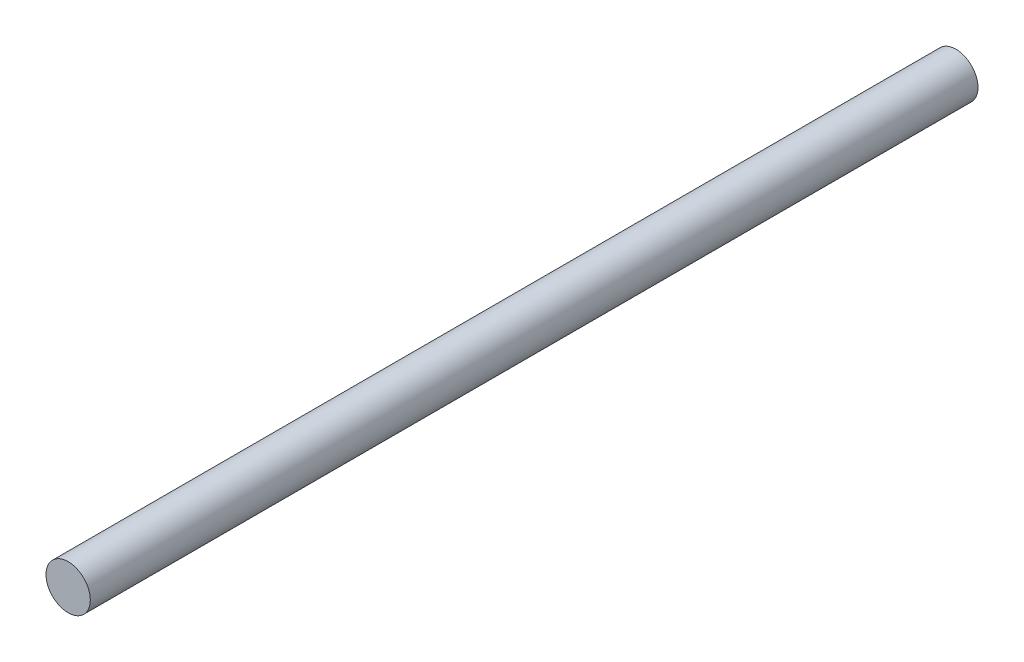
ISO-10303-21;
HEADER;
FILE_DESCRIPTION(('STEP AP214'),'2;1');
FILE_NAME('part.step','',(''),(''),'','','');
FILE_SCHEMA(('AUTOMOTIVE_DESIGN { 1 0 10303 214 1 1 1 1 }'));
ENDSEC;
DATA;
#1=APPLICATION_CONTEXT('core data for automotive mechanical design processes');
#2=APPLICATION_PROTOCOL_DEFINITION('international standard','automotive_design',2000,#1);
#3=PRODUCT_CONTEXT('',#1,'mechanical');
#4=PRODUCT('Part','Part','',(#3));
#5=PRODUCT_RELATED_PRODUCT_CATEGORY('part','',(#4));
#6=PRODUCT_DEFINITION_FORMATION('','',#4);
#7=PRODUCT_DEFINITION_CONTEXT('part definition',#1,'design');
#8=PRODUCT_DEFINITION('design','',#6,#7);
#9=PRODUCT_DEFINITION_SHAPE('','',#8);
#10=(LENGTH_UNIT() NAMED_UNIT(*) SI_UNIT(.MILLI.,.METRE.));
#11=(NAMED_UNIT(*) PLANE_ANGLE_UNIT() SI_UNIT($,.RADIAN.));
#12=(NAMED_UNIT(*) SI_UNIT($,.STERADIAN.) SOLID_ANGLE_UNIT());
#13=UNCERTAINTY_MEASURE_WITH_UNIT(LENGTH_MEASURE(1.E-05),#10,'distance_accuracy_value','');
#14=(GEOMETRIC_REPRESENTATION_CONTEXT(3) GLOBAL_UNCERTAINTY_ASSIGNED_CONTEXT((#13)) GLOBAL_UNIT_ASSIGNED_CONTEXT((#10,
#11,#12)) REPRESENTATION_CONTEXT('',''));
#15=CARTESIAN_POINT('',(0.,0.,0.));
#16=DIRECTION('',(0.,0.,1.));
#17=DIRECTION('',(1.,0.,0.));
#18=AXIS2_PLACEMENT_3D('',#15,#16,#17);
#19=CARTESIAN_POINT('',(0.,0.,32.0557346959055));
#20=DIRECTION('',(0.,0.,1.));
#21=DIRECTION('',(1.,0.,0.));
#22=AXIS2_PLACEMENT_3D('',#19,#20,#21);
#23=PLANE('',#22);
#24=CARTESIAN_POINT('',(0.,0.,32.0557346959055));
#25=DIRECTION('',(0.,0.,-1.));
#26=DIRECTION('',(-1.,0.,0.));
#27=AXIS2_PLACEMENT_3D('',#24,#25,#26);
#28=CIRCLE('',#27,1.6);
#29=CARTESIAN_POINT('',(-1.6,0.,32.0557346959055));
#30=VERTEX_POINT('',#29);
#31=EDGE_CURVE('E10',#30,#30,#28,.T.);
#32=ORIENTED_EDGE('',*,*,#31,.F.);
#33=EDGE_LOOP('',(#32));
#34=FACE_BOUND('',#33,.T.);
#35=ADVANCED_FACE('F15',(#34),#23,.T.);
#36=CARTESIAN_POINT('',(0.,0.,-32.0557346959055));
#37=DIRECTION('',(0.,0.,-1.));
#38=DIRECTION('',(-1.,0.,0.));
#39=AXIS2_PLACEMENT_3D('',#36,#37,#38);
#40=PLANE('',#39);
#41=CARTESIAN_POINT('',(0.,0.,-32.0557346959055));
#42=DIRECTION('',(0.,0.,1.));
#43=DIRECTION('',(1.,0.,0.));
#44=AXIS2_PLACEMENT_3D('',#41,#42,#43);
#45=CIRCLE('',#44,1.6);
#46=CARTESIAN_POINT('',(1.6,0.,-32.0557346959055));
#47=VERTEX_POINT('',#46);
#48=EDGE_CURVE('E22',#47,#47,#45,.T.);
#49=ORIENTED_EDGE('',*,*,#48,.F.);
#50=EDGE_LOOP('',(#49));
#51=FACE_BOUND('',#50,.T.);
#52=ADVANCED_FACE('F26',(#51),#40,.T.);
#53=CARTESIAN_POINT('',(0.,0.,-32.0557346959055));
#54=DIRECTION('',(0.,0.,1.));
#55=DIRECTION('',(1.,0.,0.));
#56=AXIS2_PLACEMENT_3D('',#53,#54,#55);
#57=CYLINDRICAL_SURFACE('',#56,1.6);
#58=ORIENTED_EDGE('',*,*,#31,.T.);
#59=EDGE_LOOP('',(#58));
#60=FACE_BOUND('',#59,.T.);
#61=ORIENTED_EDGE('',*,*,#48,.T.);
#62=EDGE_LOOP('',(#61));
#63=FACE_BOUND('',#62,.T.);
#64=ADVANCED_FACE('F17',(#60,#63),#57,.T.);
#65=CLOSED_SHELL('',(#35,#52,#64));
#66=MANIFOLD_SOLID_BREP('B1',#65);
#67=ADVANCED_BREP_SHAPE_REPRESENTATION('',(#18,#66),#14);
#68=SHAPE_DEFINITION_REPRESENTATION(#9,#67);
ENDSEC;
END-ISO-10303-21;
